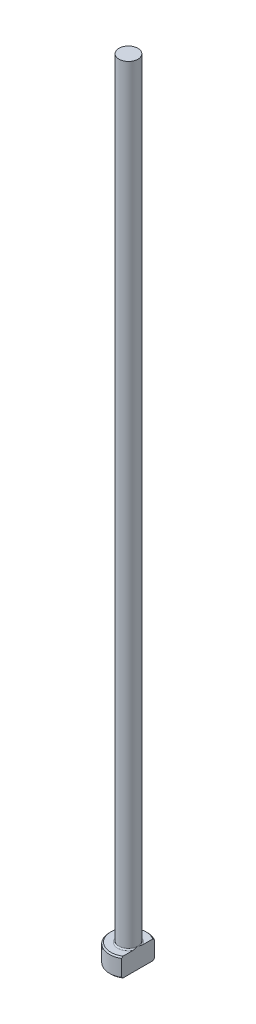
from build123d import *
from build123d.topology import SkipClean

# Parameters (mm, degrees)
CHAMFER1_SIZE = 0.2
FILLET1_R     = 0.2
KEY_DEPTH     = 126.071979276


with BuildPart() as part:
    # Sketch1 → Revolve1 (revolve)
    with BuildSketch(Plane.XY, mode=Mode.PRIVATE) as revolve1_sk:
        Polygon((0, 0), (-3, 0), (-3, 3), (-1.5, 3), (-1.5, 125), (0, 125), align=None)
    revolve(revolve1_sk.sketch.rotate(Axis((0, 259.958771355, 0), (0, -1, 0)), 270), axis=Axis((0, 259.958771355, 0), (0, -1, 0)))

    # Chamfer1
    chamfer1_edges = [part.edges().sort_by_distance(p)[0] for p in [
        (0, 3, -3),
        (0, 0, -3),
    ]]
    chamfer(chamfer1_edges, length=CHAMFER1_SIZE)

    # Fillet1
    fillet1_edges = [part.edges().sort_by_distance(p)[0] for p in [
        (0, 3, -1.5),
    ]]
    fillet(fillet1_edges, radius=FILLET1_R)

    # Sketch2 → KEY (cut, through all)
    with SkipClean():  # the faces are left unmerged after this step: merging them gives an invalid solid
        with BuildSketch(Plane(origin=(0, 0, 0), x_dir=(1, 0, 0), z_dir=(0, 1, 0))):
            with BuildLine():
                Line((1.5, 2.598076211), (1.5, -2.598076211))
                ThreePointArc((1.5, -2.598076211), (3, 0), (1.5, 2.598076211))
            make_face()
        extrude(amount=KEY_DEPTH, mode=Mode.SUBTRACT)


solid = part.part
